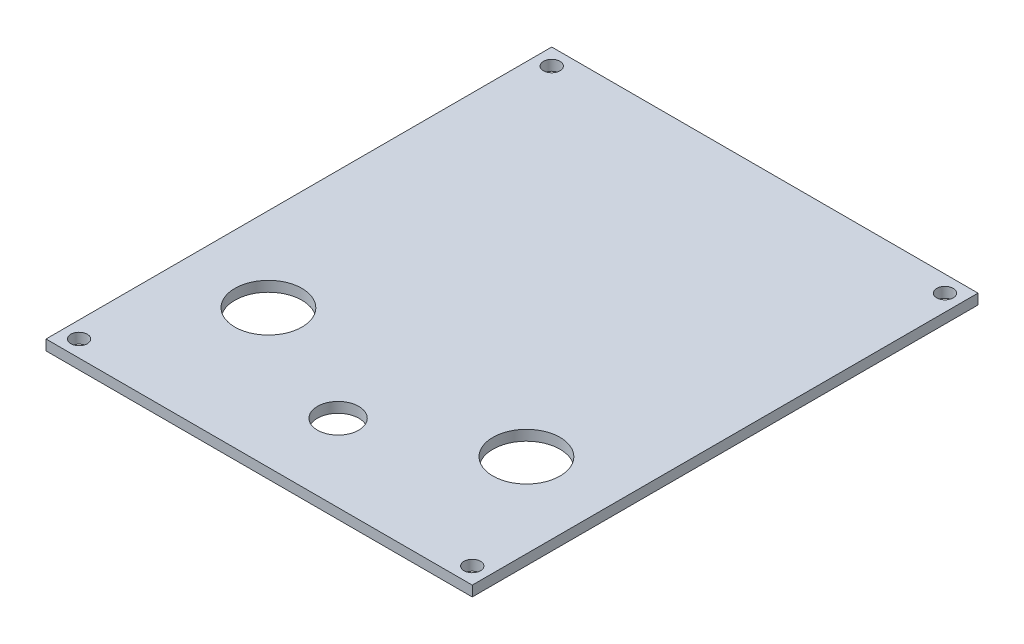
ISO-10303-21;
HEADER;
FILE_DESCRIPTION(('STEP AP214'),'2;1');
FILE_NAME('part.step','',(''),(''),'','','');
FILE_SCHEMA(('AUTOMOTIVE_DESIGN { 1 0 10303 214 1 1 1 1 }'));
ENDSEC;
DATA;
#1=APPLICATION_CONTEXT('core data for automotive mechanical design processes');
#2=APPLICATION_PROTOCOL_DEFINITION('international standard','automotive_design',2000,#1);
#3=PRODUCT_CONTEXT('',#1,'mechanical');
#4=PRODUCT('Part','Part','',(#3));
#5=PRODUCT_RELATED_PRODUCT_CATEGORY('part','',(#4));
#6=PRODUCT_DEFINITION_FORMATION('','',#4);
#7=PRODUCT_DEFINITION_CONTEXT('part definition',#1,'design');
#8=PRODUCT_DEFINITION('design','',#6,#7);
#9=PRODUCT_DEFINITION_SHAPE('','',#8);
#10=(LENGTH_UNIT() NAMED_UNIT(*) SI_UNIT(.MILLI.,.METRE.));
#11=(NAMED_UNIT(*) PLANE_ANGLE_UNIT() SI_UNIT($,.RADIAN.));
#12=(NAMED_UNIT(*) SI_UNIT($,.STERADIAN.) SOLID_ANGLE_UNIT());
#13=UNCERTAINTY_MEASURE_WITH_UNIT(LENGTH_MEASURE(1.E-05),#10,'distance_accuracy_value','');
#14=(GEOMETRIC_REPRESENTATION_CONTEXT(3) GLOBAL_UNCERTAINTY_ASSIGNED_CONTEXT((#13)) GLOBAL_UNIT_ASSIGNED_CONTEXT((#10,
#11,#12)) REPRESENTATION_CONTEXT('',''));
#15=CARTESIAN_POINT('',(0.,0.,0.));
#16=DIRECTION('',(0.,0.,1.));
#17=DIRECTION('',(1.,0.,0.));
#18=AXIS2_PLACEMENT_3D('',#15,#16,#17);
#19=CARTESIAN_POINT('',(-41.3,2.,-49.));
#20=DIRECTION('',(1.,0.,0.));
#21=DIRECTION('',(0.,0.,-1.));
#22=AXIS2_PLACEMENT_3D('',#19,#20,#21);
#23=PLANE('',#22);
#24=DIRECTION('',(0.,0.,1.));
#25=VECTOR('',#24,1.);
#26=CARTESIAN_POINT('',(-41.3,0.,-49.));
#27=LINE('',#26,#25);
#28=CARTESIAN_POINT('',(-41.3,0.,-49.));
#29=VERTEX_POINT('',#28);
#30=CARTESIAN_POINT('',(-41.3,0.,49.));
#31=VERTEX_POINT('',#30);
#32=EDGE_CURVE('E100',#29,#31,#27,.T.);
#33=ORIENTED_EDGE('',*,*,#32,.T.);
#34=DIRECTION('',(0.,-1.,0.));
#35=VECTOR('',#34,1.);
#36=CARTESIAN_POINT('',(-41.3,2.,49.));
#37=LINE('',#36,#35);
#38=CARTESIAN_POINT('',(-41.3,2.,49.));
#39=VERTEX_POINT('',#38);
#40=EDGE_CURVE('E11',#39,#31,#37,.T.);
#41=ORIENTED_EDGE('',*,*,#40,.F.);
#42=DIRECTION('',(0.,0.,1.));
#43=VECTOR('',#42,1.);
#44=CARTESIAN_POINT('',(-41.3,2.,-49.));
#45=LINE('',#44,#43);
#46=CARTESIAN_POINT('',(-41.3,2.,-49.));
#47=VERTEX_POINT('',#46);
#48=EDGE_CURVE('E87',#47,#39,#45,.T.);
#49=ORIENTED_EDGE('',*,*,#48,.F.);
#50=DIRECTION('',(0.,-1.,0.));
#51=VECTOR('',#50,1.);
#52=CARTESIAN_POINT('',(-41.3,2.,-49.));
#53=LINE('',#52,#51);
#54=EDGE_CURVE('E96',#47,#29,#53,.T.);
#55=ORIENTED_EDGE('',*,*,#54,.T.);
#56=EDGE_LOOP('',(#33,#41,#49,#55));
#57=FACE_BOUND('',#56,.T.);
#58=ADVANCED_FACE('F35',(#57),#23,.F.);
#59=CARTESIAN_POINT('',(41.3,2.,49.));
#60=DIRECTION('',(0.,0.,-1.));
#61=DIRECTION('',(-1.,0.,0.));
#62=AXIS2_PLACEMENT_3D('',#59,#60,#61);
#63=PLANE('',#62);
#64=DIRECTION('',(1.,0.,0.));
#65=VECTOR('',#64,1.);
#66=CARTESIAN_POINT('',(41.3,0.,49.));
#67=LINE('',#66,#65);
#68=CARTESIAN_POINT('',(41.3,0.,49.));
#69=VERTEX_POINT('',#68);
#70=EDGE_CURVE('E91',#31,#69,#67,.T.);
#71=ORIENTED_EDGE('',*,*,#70,.T.);
#72=DIRECTION('',(0.,-1.,0.));
#73=VECTOR('',#72,1.);
#74=CARTESIAN_POINT('',(41.3,2.,49.));
#75=LINE('',#74,#73);
#76=CARTESIAN_POINT('',(41.3,2.,49.));
#77=VERTEX_POINT('',#76);
#78=EDGE_CURVE('E44',#77,#69,#75,.T.);
#79=ORIENTED_EDGE('',*,*,#78,.F.);
#80=DIRECTION('',(1.,0.,0.));
#81=VECTOR('',#80,1.);
#82=CARTESIAN_POINT('',(41.3,2.,49.));
#83=LINE('',#82,#81);
#84=EDGE_CURVE('E82',#39,#77,#83,.T.);
#85=ORIENTED_EDGE('',*,*,#84,.F.);
#86=ORIENTED_EDGE('',*,*,#40,.T.);
#87=EDGE_LOOP('',(#71,#79,#85,#86));
#88=FACE_BOUND('',#87,.T.);
#89=ADVANCED_FACE('F90',(#88),#63,.F.);
#90=CARTESIAN_POINT('',(41.3,2.,-49.));
#91=DIRECTION('',(-1.,0.,0.));
#92=DIRECTION('',(0.,0.,1.));
#93=AXIS2_PLACEMENT_3D('',#90,#91,#92);
#94=PLANE('',#93);
#95=DIRECTION('',(0.,0.,-1.));
#96=VECTOR('',#95,1.);
#97=CARTESIAN_POINT('',(41.3,0.,-49.));
#98=LINE('',#97,#96);
#99=CARTESIAN_POINT('',(41.3,0.,-49.));
#100=VERTEX_POINT('',#99);
#101=EDGE_CURVE('E69',#69,#100,#98,.T.);
#102=ORIENTED_EDGE('',*,*,#101,.T.);
#103=DIRECTION('',(0.,-1.,0.));
#104=VECTOR('',#103,1.);
#105=CARTESIAN_POINT('',(41.3,2.,-49.));
#106=LINE('',#105,#104);
#107=CARTESIAN_POINT('',(41.3,2.,-49.));
#108=VERTEX_POINT('',#107);
#109=EDGE_CURVE('E92',#108,#100,#106,.T.);
#110=ORIENTED_EDGE('',*,*,#109,.F.);
#111=DIRECTION('',(0.,0.,-1.));
#112=VECTOR('',#111,1.);
#113=CARTESIAN_POINT('',(41.3,2.,-49.));
#114=LINE('',#113,#112);
#115=EDGE_CURVE('E85',#77,#108,#114,.T.);
#116=ORIENTED_EDGE('',*,*,#115,.F.);
#117=ORIENTED_EDGE('',*,*,#78,.T.);
#118=EDGE_LOOP('',(#102,#110,#116,#117));
#119=FACE_BOUND('',#118,.T.);
#120=ADVANCED_FACE('F94',(#119),#94,.F.);
#121=CARTESIAN_POINT('',(41.3,2.,-49.));
#122=DIRECTION('',(0.,0.,1.));
#123=DIRECTION('',(1.,0.,0.));
#124=AXIS2_PLACEMENT_3D('',#121,#122,#123);
#125=PLANE('',#124);
#126=DIRECTION('',(-1.,0.,0.));
#127=VECTOR('',#126,1.);
#128=CARTESIAN_POINT('',(41.3,0.,-49.));
#129=LINE('',#128,#127);
#130=EDGE_CURVE('E75',#100,#29,#129,.T.);
#131=ORIENTED_EDGE('',*,*,#130,.T.);
#132=ORIENTED_EDGE('',*,*,#54,.F.);
#133=DIRECTION('',(-1.,0.,0.));
#134=VECTOR('',#133,1.);
#135=CARTESIAN_POINT('',(41.3,2.,-49.));
#136=LINE('',#135,#134);
#137=EDGE_CURVE('E52',#108,#47,#136,.T.);
#138=ORIENTED_EDGE('',*,*,#137,.F.);
#139=ORIENTED_EDGE('',*,*,#109,.T.);
#140=EDGE_LOOP('',(#131,#132,#138,#139));
#141=FACE_BOUND('',#140,.T.);
#142=ADVANCED_FACE('F108',(#141),#125,.F.);
#143=CARTESIAN_POINT('',(0.,2.,0.));
#144=DIRECTION('',(0.,-1.,0.));
#145=DIRECTION('',(0.,0.,-1.));
#146=AXIS2_PLACEMENT_3D('',#143,#144,#145);
#147=PLANE('',#146);
#148=CARTESIAN_POINT('',(0.300000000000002,2.,34.));
#149=DIRECTION('',(0.,1.,0.));
#150=DIRECTION('',(0.,0.,1.));
#151=AXIS2_PLACEMENT_3D('',#148,#149,#150);
#152=CIRCLE('',#151,4.);
#153=CARTESIAN_POINT('',(0.300000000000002,2.,38.));
#154=VERTEX_POINT('',#153);
#155=EDGE_CURVE('E149',#154,#154,#152,.T.);
#156=ORIENTED_EDGE('',*,*,#155,.F.);
#157=EDGE_LOOP('',(#156));
#158=FACE_BOUND('',#157,.T.);
#159=CARTESIAN_POINT('',(25.,2.,22.2));
#160=DIRECTION('',(0.,1.,0.));
#161=DIRECTION('',(0.,0.,1.));
#162=AXIS2_PLACEMENT_3D('',#159,#160,#161);
#163=CIRCLE('',#162,6.5);
#164=CARTESIAN_POINT('',(25.,2.,28.7));
#165=VERTEX_POINT('',#164);
#166=EDGE_CURVE('E144',#165,#165,#163,.T.);
#167=ORIENTED_EDGE('',*,*,#166,.F.);
#168=EDGE_LOOP('',(#167));
#169=FACE_BOUND('',#168,.T.);
#170=CARTESIAN_POINT('',(-25.,2.,22.2));
#171=DIRECTION('',(0.,1.,0.));
#172=DIRECTION('',(0.,0.,1.));
#173=AXIS2_PLACEMENT_3D('',#170,#171,#172);
#174=CIRCLE('',#173,6.5);
#175=CARTESIAN_POINT('',(-25.,2.,28.7));
#176=VERTEX_POINT('',#175);
#177=EDGE_CURVE('E138',#176,#176,#174,.T.);
#178=ORIENTED_EDGE('',*,*,#177,.F.);
#179=EDGE_LOOP('',(#178));
#180=FACE_BOUND('',#179,.T.);
#181=CARTESIAN_POINT('',(-38.1,2.,-45.8));
#182=DIRECTION('',(0.,1.,0.));
#183=DIRECTION('',(0.,0.,1.));
#184=AXIS2_PLACEMENT_3D('',#181,#182,#183);
#185=CIRCLE('',#184,1.59999999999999);
#186=CARTESIAN_POINT('',(-38.1,2.,-44.2));
#187=VERTEX_POINT('',#186);
#188=EDGE_CURVE('E134',#187,#187,#185,.T.);
#189=ORIENTED_EDGE('',*,*,#188,.F.);
#190=EDGE_LOOP('',(#189));
#191=FACE_BOUND('',#190,.T.);
#192=CARTESIAN_POINT('',(38.1,2.,-45.8));
#193=DIRECTION('',(0.,1.,0.));
#194=DIRECTION('',(0.,0.,1.));
#195=AXIS2_PLACEMENT_3D('',#192,#193,#194);
#196=CIRCLE('',#195,1.59999999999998);
#197=CARTESIAN_POINT('',(38.1,2.,-44.2));
#198=VERTEX_POINT('',#197);
#199=EDGE_CURVE('E128',#198,#198,#196,.T.);
#200=ORIENTED_EDGE('',*,*,#199,.F.);
#201=EDGE_LOOP('',(#200));
#202=FACE_BOUND('',#201,.T.);
#203=CARTESIAN_POINT('',(38.1,2.,45.8));
#204=DIRECTION('',(0.,1.,0.));
#205=DIRECTION('',(0.,0.,1.));
#206=AXIS2_PLACEMENT_3D('',#203,#204,#205);
#207=CIRCLE('',#206,1.59999999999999);
#208=CARTESIAN_POINT('',(38.1,2.,47.4));
#209=VERTEX_POINT('',#208);
#210=EDGE_CURVE('E122',#209,#209,#207,.T.);
#211=ORIENTED_EDGE('',*,*,#210,.F.);
#212=EDGE_LOOP('',(#211));
#213=FACE_BOUND('',#212,.T.);
#214=CARTESIAN_POINT('',(-38.1,2.,45.8));
#215=DIRECTION('',(0.,1.,0.));
#216=DIRECTION('',(0.,0.,1.));
#217=AXIS2_PLACEMENT_3D('',#214,#215,#216);
#218=CIRCLE('',#217,1.59999999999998);
#219=CARTESIAN_POINT('',(-38.1,2.,47.4));
#220=VERTEX_POINT('',#219);
#221=EDGE_CURVE('E116',#220,#220,#218,.T.);
#222=ORIENTED_EDGE('',*,*,#221,.F.);
#223=EDGE_LOOP('',(#222));
#224=FACE_BOUND('',#223,.T.);
#225=ORIENTED_EDGE('',*,*,#48,.T.);
#226=ORIENTED_EDGE('',*,*,#84,.T.);
#227=ORIENTED_EDGE('',*,*,#115,.T.);
#228=ORIENTED_EDGE('',*,*,#137,.T.);
#229=EDGE_LOOP('',(#225,#226,#227,#228));
#230=FACE_BOUND('',#229,.T.);
#231=ADVANCED_FACE('F83',(#158,#169,#180,#191,#202,#213,#224,#230),#147,.F.);
#232=CARTESIAN_POINT('',(0.,0.,0.));
#233=DIRECTION('',(0.,-1.,0.));
#234=DIRECTION('',(0.,0.,-1.));
#235=AXIS2_PLACEMENT_3D('',#232,#233,#234);
#236=PLANE('',#235);
#237=CARTESIAN_POINT('',(0.300000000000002,0.,34.));
#238=DIRECTION('',(0.,-1.,0.));
#239=DIRECTION('',(0.,0.,-1.));
#240=AXIS2_PLACEMENT_3D('',#237,#238,#239);
#241=CIRCLE('',#240,4.);
#242=CARTESIAN_POINT('',(0.300000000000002,0.,30.));
#243=VERTEX_POINT('',#242);
#244=EDGE_CURVE('E38',#243,#243,#241,.T.);
#245=ORIENTED_EDGE('',*,*,#244,.F.);
#246=EDGE_LOOP('',(#245));
#247=FACE_BOUND('',#246,.T.);
#248=CARTESIAN_POINT('',(25.,0.,22.2));
#249=DIRECTION('',(0.,1.,0.));
#250=DIRECTION('',(0.,0.,1.));
#251=AXIS2_PLACEMENT_3D('',#248,#249,#250);
#252=CIRCLE('',#251,6.5);
#253=CARTESIAN_POINT('',(25.,0.,28.7));
#254=VERTEX_POINT('',#253);
#255=EDGE_CURVE('E141',#254,#254,#252,.T.);
#256=ORIENTED_EDGE('',*,*,#255,.T.);
#257=EDGE_LOOP('',(#256));
#258=FACE_BOUND('',#257,.T.);
#259=CARTESIAN_POINT('',(-25.,0.,22.2));
#260=DIRECTION('',(0.,1.,0.));
#261=DIRECTION('',(0.,0.,1.));
#262=AXIS2_PLACEMENT_3D('',#259,#260,#261);
#263=CIRCLE('',#262,6.5);
#264=CARTESIAN_POINT('',(-25.,0.,28.7));
#265=VERTEX_POINT('',#264);
#266=EDGE_CURVE('E137',#265,#265,#263,.T.);
#267=ORIENTED_EDGE('',*,*,#266,.T.);
#268=EDGE_LOOP('',(#267));
#269=FACE_BOUND('',#268,.T.);
#270=CARTESIAN_POINT('',(-38.1,0.,-45.8));
#271=DIRECTION('',(0.,1.,0.));
#272=DIRECTION('',(0.,0.,1.));
#273=AXIS2_PLACEMENT_3D('',#270,#271,#272);
#274=CIRCLE('',#273,1.59999999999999);
#275=CARTESIAN_POINT('',(-38.1,0.,-44.2));
#276=VERTEX_POINT('',#275);
#277=EDGE_CURVE('E131',#276,#276,#274,.T.);
#278=ORIENTED_EDGE('',*,*,#277,.T.);
#279=EDGE_LOOP('',(#278));
#280=FACE_BOUND('',#279,.T.);
#281=CARTESIAN_POINT('',(38.1,0.,-45.8));
#282=DIRECTION('',(0.,1.,0.));
#283=DIRECTION('',(0.,0.,1.));
#284=AXIS2_PLACEMENT_3D('',#281,#282,#283);
#285=CIRCLE('',#284,1.59999999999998);
#286=CARTESIAN_POINT('',(38.1,0.,-44.2));
#287=VERTEX_POINT('',#286);
#288=EDGE_CURVE('E125',#287,#287,#285,.T.);
#289=ORIENTED_EDGE('',*,*,#288,.T.);
#290=EDGE_LOOP('',(#289));
#291=FACE_BOUND('',#290,.T.);
#292=CARTESIAN_POINT('',(38.1,0.,45.8));
#293=DIRECTION('',(0.,1.,0.));
#294=DIRECTION('',(0.,0.,1.));
#295=AXIS2_PLACEMENT_3D('',#292,#293,#294);
#296=CIRCLE('',#295,1.59999999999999);
#297=CARTESIAN_POINT('',(38.1,0.,47.4));
#298=VERTEX_POINT('',#297);
#299=EDGE_CURVE('E119',#298,#298,#296,.T.);
#300=ORIENTED_EDGE('',*,*,#299,.T.);
#301=EDGE_LOOP('',(#300));
#302=FACE_BOUND('',#301,.T.);
#303=CARTESIAN_POINT('',(-38.1,0.,45.8));
#304=DIRECTION('',(0.,1.,0.));
#305=DIRECTION('',(0.,0.,1.));
#306=AXIS2_PLACEMENT_3D('',#303,#304,#305);
#307=CIRCLE('',#306,1.59999999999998);
#308=CARTESIAN_POINT('',(-38.1,0.,47.4));
#309=VERTEX_POINT('',#308);
#310=EDGE_CURVE('E103',#309,#309,#307,.T.);
#311=ORIENTED_EDGE('',*,*,#310,.T.);
#312=EDGE_LOOP('',(#311));
#313=FACE_BOUND('',#312,.T.);
#314=ORIENTED_EDGE('',*,*,#32,.F.);
#315=ORIENTED_EDGE('',*,*,#130,.F.);
#316=ORIENTED_EDGE('',*,*,#101,.F.);
#317=ORIENTED_EDGE('',*,*,#70,.F.);
#318=EDGE_LOOP('',(#314,#315,#316,#317));
#319=FACE_BOUND('',#318,.T.);
#320=ADVANCED_FACE('F111',(#247,#258,#269,#280,#291,#302,#313,#319),#236,.T.);
#321=CARTESIAN_POINT('',(-38.1,2.,45.8));
#322=DIRECTION('',(0.,1.,0.));
#323=DIRECTION('',(0.,0.,1.));
#324=AXIS2_PLACEMENT_3D('',#321,#322,#323);
#325=CYLINDRICAL_SURFACE('',#324,1.59999999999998);
#326=ORIENTED_EDGE('',*,*,#310,.F.);
#327=EDGE_LOOP('',(#326));
#328=FACE_BOUND('',#327,.T.);
#329=ORIENTED_EDGE('',*,*,#221,.T.);
#330=EDGE_LOOP('',(#329));
#331=FACE_BOUND('',#330,.T.);
#332=ADVANCED_FACE('F160',(#328,#331),#325,.F.);
#333=CARTESIAN_POINT('',(38.1,2.,45.8));
#334=DIRECTION('',(0.,1.,0.));
#335=DIRECTION('',(0.,0.,1.));
#336=AXIS2_PLACEMENT_3D('',#333,#334,#335);
#337=CYLINDRICAL_SURFACE('',#336,1.59999999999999);
#338=ORIENTED_EDGE('',*,*,#299,.F.);
#339=EDGE_LOOP('',(#338));
#340=FACE_BOUND('',#339,.T.);
#341=ORIENTED_EDGE('',*,*,#210,.T.);
#342=EDGE_LOOP('',(#341));
#343=FACE_BOUND('',#342,.T.);
#344=ADVANCED_FACE('F176',(#340,#343),#337,.F.);
#345=CARTESIAN_POINT('',(38.1,2.,-45.8));
#346=DIRECTION('',(0.,1.,0.));
#347=DIRECTION('',(0.,0.,1.));
#348=AXIS2_PLACEMENT_3D('',#345,#346,#347);
#349=CYLINDRICAL_SURFACE('',#348,1.59999999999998);
#350=ORIENTED_EDGE('',*,*,#288,.F.);
#351=EDGE_LOOP('',(#350));
#352=FACE_BOUND('',#351,.T.);
#353=ORIENTED_EDGE('',*,*,#199,.T.);
#354=EDGE_LOOP('',(#353));
#355=FACE_BOUND('',#354,.T.);
#356=ADVANCED_FACE('F224',(#352,#355),#349,.F.);
#357=CARTESIAN_POINT('',(-38.1,2.,-45.8));
#358=DIRECTION('',(0.,1.,0.));
#359=DIRECTION('',(0.,0.,1.));
#360=AXIS2_PLACEMENT_3D('',#357,#358,#359);
#361=CYLINDRICAL_SURFACE('',#360,1.59999999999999);
#362=ORIENTED_EDGE('',*,*,#277,.F.);
#363=EDGE_LOOP('',(#362));
#364=FACE_BOUND('',#363,.T.);
#365=ORIENTED_EDGE('',*,*,#188,.T.);
#366=EDGE_LOOP('',(#365));
#367=FACE_BOUND('',#366,.T.);
#368=ADVANCED_FACE('F232',(#364,#367),#361,.F.);
#369=CARTESIAN_POINT('',(-25.,0.,22.2));
#370=DIRECTION('',(0.,1.,0.));
#371=DIRECTION('',(0.,0.,1.));
#372=AXIS2_PLACEMENT_3D('',#369,#370,#371);
#373=CYLINDRICAL_SURFACE('',#372,6.5);
#374=ORIENTED_EDGE('',*,*,#266,.F.);
#375=EDGE_LOOP('',(#374));
#376=FACE_BOUND('',#375,.T.);
#377=ORIENTED_EDGE('',*,*,#177,.T.);
#378=EDGE_LOOP('',(#377));
#379=FACE_BOUND('',#378,.T.);
#380=ADVANCED_FACE('F240',(#376,#379),#373,.F.);
#381=CARTESIAN_POINT('',(25.,0.,22.2));
#382=DIRECTION('',(0.,1.,0.));
#383=DIRECTION('',(0.,0.,1.));
#384=AXIS2_PLACEMENT_3D('',#381,#382,#383);
#385=CYLINDRICAL_SURFACE('',#384,6.5);
#386=ORIENTED_EDGE('',*,*,#255,.F.);
#387=EDGE_LOOP('',(#386));
#388=FACE_BOUND('',#387,.T.);
#389=ORIENTED_EDGE('',*,*,#166,.T.);
#390=EDGE_LOOP('',(#389));
#391=FACE_BOUND('',#390,.T.);
#392=ADVANCED_FACE('F248',(#388,#391),#385,.F.);
#393=CARTESIAN_POINT('',(0.300000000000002,-8.,34.));
#394=DIRECTION('',(0.,1.,0.));
#395=DIRECTION('',(0.,0.,1.));
#396=AXIS2_PLACEMENT_3D('',#393,#394,#395);
#397=CYLINDRICAL_SURFACE('',#396,4.);
#398=ORIENTED_EDGE('',*,*,#244,.T.);
#399=EDGE_LOOP('',(#398));
#400=FACE_BOUND('',#399,.T.);
#401=ORIENTED_EDGE('',*,*,#155,.T.);
#402=EDGE_LOOP('',(#401));
#403=FACE_BOUND('',#402,.T.);
#404=ADVANCED_FACE('F156',(#400,#403),#397,.F.);
#405=CLOSED_SHELL('',(#58,#89,#120,#142,#231,#320,#332,#344,#356,#368,#380,#392,#404));
#406=MANIFOLD_SOLID_BREP('B2',#405);
#407=ADVANCED_BREP_SHAPE_REPRESENTATION('',(#18,#406),#14);
#408=SHAPE_DEFINITION_REPRESENTATION(#9,#407);
ENDSEC;
END-ISO-10303-21;
